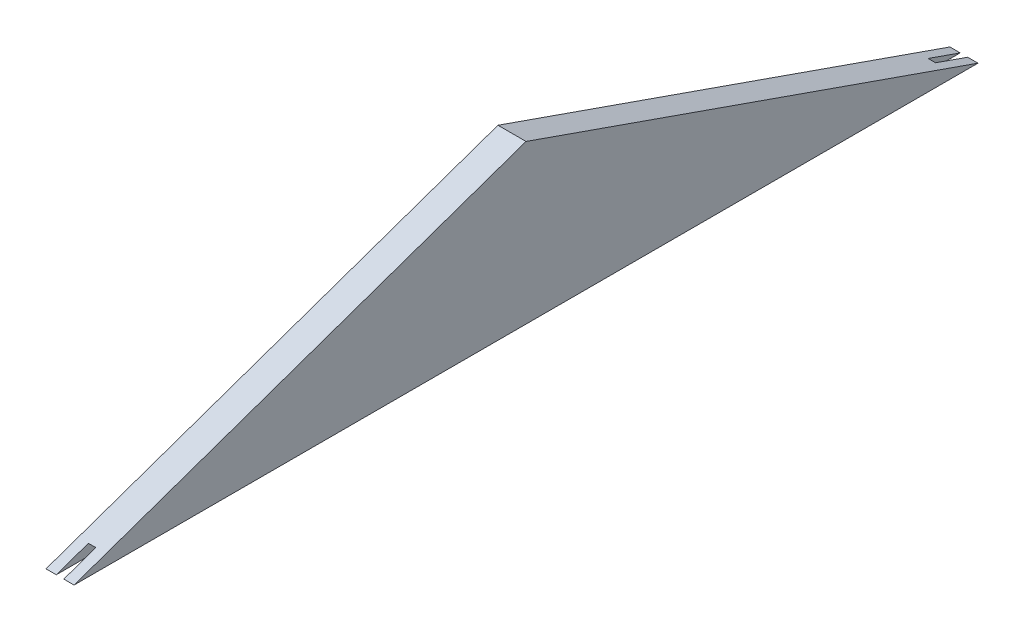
from build123d import *

# Parameters (mm, degrees)
ESQUISSE1_W                  = 4
ESQUISSE1_H                  = 8
BOSS_EXTRU_1_DEPTH           = 482.9
ENL_V_MAT_EXTRU_1_DEPTH      = 486.696314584
ENL_V_MAT_EXTRU_1_DEPTH_BACK = 486.696314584


with BuildPart() as part:
    # Esquisse1 → Boss.-Extru.1 (new body)
    with BuildSketch(Plane.XY):
        with Locations((0, 47.5)):
            Rectangle(ESQUISSE1_W, ESQUISSE1_H)
        with Locations((0, 39.5)):
            Rectangle(ESQUISSE1_W, ESQUISSE1_H)
        Polygon((-2, 43.5), (-7.5, 43.5), (-7.5, -43.5), (-2, -43.5), (-2, -37.5), (2, -37.5), (2, -43.5), (7.5, -43.5), (7.5, 43.5), (2, 43.5), (2, 35.5), (-2, 35.5), align=None)
    extrude(amount=BOSS_EXTRU_1_DEPTH)

    # Esquisse2 → Enl_v. mat.-Extru.1 (cut, two sides: drawn at the far end of the back side and taken through both)
    with BuildSketch(Plane(origin=(0, 0, 0), x_dir=(0, 0, -1), z_dir=(1, 0, 0)).offset(-ENL_V_MAT_EXTRU_1_DEPTH_BACK)):
        Polygon((-482.9, -43.5), (-211.470726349, 51.5), (-482.9, 51.5), align=None)
        Polygon((0, -43.5), (-271.429273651, 51.5), (0, 51.5), align=None)
    extrude(amount=ENL_V_MAT_EXTRU_1_DEPTH + ENL_V_MAT_EXTRU_1_DEPTH_BACK, mode=Mode.SUBTRACT)


solid = part.part
